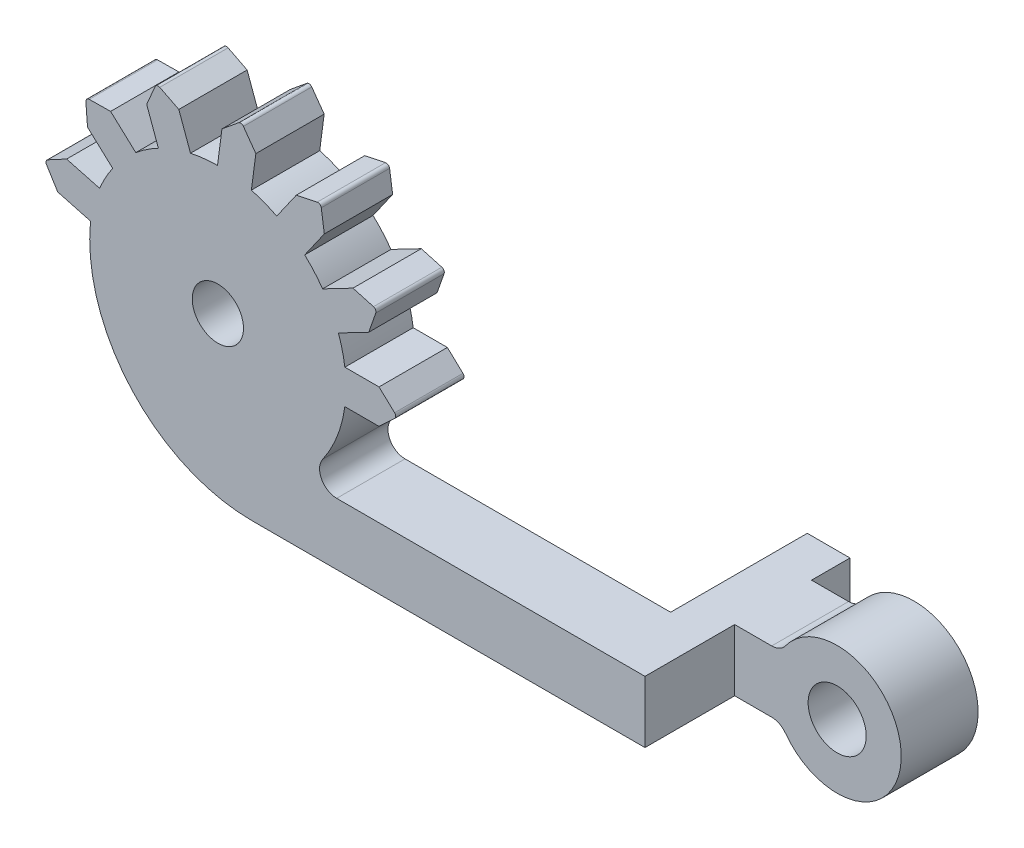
from build123d import *

# Parameters (mm, degrees)
BOSS_EXTRUDE1_DEPTH  = 4
SKETCH8_R            = 1.5
CUT_EXTRUDE1_DEPTH   = 68.447626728
BOSS_EXTRUDE4_DEPTH  = 4
SKETCH3_W            = 2.5
SKETCH3_H            = 3.612645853
BOSS_EXTRUDE2_DEPTH  = 8
BOSS_EXTRUDE5_START  = -7.5
BOSS_EXTRUDE5_DEPTH  = 2.25
M3_CLEARANCE_HOLE1_D = 3.4


with BuildPart() as part:
    # Sketch1 → Boss-Extrude1 (new body)
    with BuildSketch(Plane.XY):
        with BuildLine():
            Line((66.618358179, -3.631499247), (66.618358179, -7.2441451))
            Line((66.618358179, -7.2441451), (43.618358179, -7.2441451))
            ThreePointArc((43.618358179, -7.2441451), (36.900843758, -4.461659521), (34.118358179, 2.2558549))
            ThreePointArc((34.118358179, 2.2558549), (43.879794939, 9.406792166), (47.754599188, -2.056516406))
            ThreePointArc((47.754599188, -2.056516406), (47.685357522, -3.092485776), (48.572764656, -3.631499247))
            Line((48.572764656, -3.631499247), (66.618358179, -3.631499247))
        make_face()
    extrude(amount=-BOSS_EXTRUDE1_DEPTH)

    # Sketch8 → Cut-Extrude1 (cut, through all)
    with BuildSketch(Plane.XY):
        with Locations((41.618358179, 2.2558549)):
            Circle(SKETCH8_R)
    extrude(amount=-CUT_EXTRUDE1_DEPTH, mode=Mode.SUBTRACT)

    # Sketch5 → Boss-Extrude4 (add)
    with BuildSketch(Plane.XY):
        with BuildLine():
            ThreePointArc((34.179779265, 3.213739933), (34.373914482, 4.196997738), (34.697417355, 5.145591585))
            Line((34.697417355, 5.145591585), (32.765565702, 5.663229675))
            Line((32.765565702, 5.663229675), (31.664298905, 5.074111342))
            ThreePointArc((31.664298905, 5.074111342), (31.565452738, 4.949522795), (31.588761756, 4.792202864))
            Line((31.588761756, 4.792202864), (32.247927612, 3.731378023))
            Line((32.247927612, 3.731378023), (34.179779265, 3.213739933))
        make_face()
        with BuildLine():
            ThreePointArc((35.462560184, 6.540262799), (36.088778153, 7.322781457), (36.813740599, 8.014817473))
            Line((36.813740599, 8.014817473), (35.339185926, 9.365997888))
            Line((35.339185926, 9.365997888), (34.090325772, 9.35195196))
            ThreePointArc((34.090325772, 9.35195196), (33.945119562, 9.28708265), (33.893152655, 9.136775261))
            Line((33.893152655, 9.136775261), (33.98800551, 7.891443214))
            Line((33.98800551, 7.891443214), (35.462560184, 6.540262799))
        make_face()
        with BuildLine():
            ThreePointArc((38.136418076, 8.898602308), (39.053207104, 9.303549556), (40.015803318, 9.582642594))
            Line((40.015803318, 9.582642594), (39.331763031, 11.462027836))
            Line((39.331763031, 11.462027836), (38.217524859, 12.02622839))
            ThreePointArc((38.217524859, 12.02622839), (38.058772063, 12.035737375), (37.943272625, 11.92640874))
            Line((37.943272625, 11.92640874), (37.45237779, 10.777987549))
            Line((37.45237779, 10.777987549), (38.136418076, 8.898602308))
        make_face()
        with BuildLine():
            ThreePointArc((41.597118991, 9.755824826), (42.597304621, 9.69169136), (43.580008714, 9.494772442))
            Line((43.580008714, 9.494772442), (43.841061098, 11.477662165))
            Line((43.841061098, 11.477662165), (43.113238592, 12.492612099))
            ThreePointArc((43.113238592, 12.492612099), (42.976813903, 12.574350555), (42.823882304, 12.530706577))
            Line((42.823882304, 12.530706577), (41.858171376, 11.738714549))
            Line((41.858171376, 11.738714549), (41.597118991, 9.755824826))
        make_face()
        with BuildLine():
            ThreePointArc((45.062619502, 8.918216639), (45.920181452, 8.399495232), (46.700923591, 7.771063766))
            Line((46.700923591, 7.771063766), (47.848076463, 9.409367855))
            Line((47.848076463, 9.409367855), (47.67114174, 10.645710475))
            ThreePointArc((47.67114174, 10.645710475), (47.587874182, 10.781207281), (47.432069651, 10.813110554))
            Line((47.432069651, 10.813110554), (46.209772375, 10.556520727))
            Line((46.209772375, 10.556520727), (45.062619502, 8.918216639))
        make_face()
        with BuildLine():
            ThreePointArc((47.749791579, 6.575059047), (48.270939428, 5.718969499), (48.673288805, 4.801037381))
            Line((48.673288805, 4.801037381), (50.447310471, 5.724534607))
            Line((50.447310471, 5.724534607), (50.861246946, 6.902883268))
            ThreePointArc((50.861246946, 6.902883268), (50.849953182, 7.061519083), (50.726484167, 7.161760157))
            Line((50.726484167, 7.161760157), (49.523813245, 7.498556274))
            Line((49.523813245, 7.498556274), (47.749791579, 6.575059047))
        make_face()
        with BuildLine():
            ThreePointArc((49.051392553, 3.2558549), (49.118358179, 2.2558549), (49.051392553, 1.2558549))
            Line((49.051392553, 1.2558549), (51.051392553, 1.2558549))
            Line((51.051392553, 1.2558549), (51.962659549, 2.109928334))
            ThreePointArc((51.962659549, 2.109928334), (52.025891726, 2.2558549), (51.962659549, 2.401781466))
            Line((51.962659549, 2.401781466), (51.051392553, 3.2558549))
            Line((51.051392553, 3.2558549), (49.051392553, 3.2558549))
        make_face()
    extrude(amount=-BOSS_EXTRUDE4_DEPTH)

    # Sketch3 → Boss-Extrude2 (add)
    with BuildSketch(Plane(origin=(0, 0, -4), x_dir=(-1, 0, 0), z_dir=(0, 0, -1))):
        with Locations((-65.368358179, -5.437822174)):
            Rectangle(SKETCH3_W, SKETCH3_H)
    extrude(amount=BOSS_EXTRUDE2_DEPTH)

    # Sketch9 → Boss-Extrude5 (add, symmetric)
    with BuildSketch(Plane.XY.offset(BOSS_EXTRUDE5_START)):
        with BuildLine():
            Line((68.785989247, -3.631499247), (66.618358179, -3.631499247))
            Line((66.618358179, -3.631499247), (66.618358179, -7.2441451))
            Line((66.618358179, -7.2441451), (68.785989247, -7.2441451))
            ThreePointArc((68.785989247, -7.2441451), (69.238313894, -7.352291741), (69.592803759, -7.653340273))
            ThreePointArc((69.592803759, -7.653340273), (76.368358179, -5.437822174), (69.592803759, -3.222304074))
            ThreePointArc((69.592803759, -3.222304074), (69.238313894, -3.523352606), (68.785989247, -3.631499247))
        make_face()
    extrude(amount=BOSS_EXTRUDE5_DEPTH, both=True)

    # M3 Clearance Hole1 (through all)
    with Locations(Plane.XY.offset(-5.25)):
        with Locations((72.618358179, -5.437822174)):
            Hole(M3_CLEARANCE_HOLE1_D / 2)


solid = part.part
